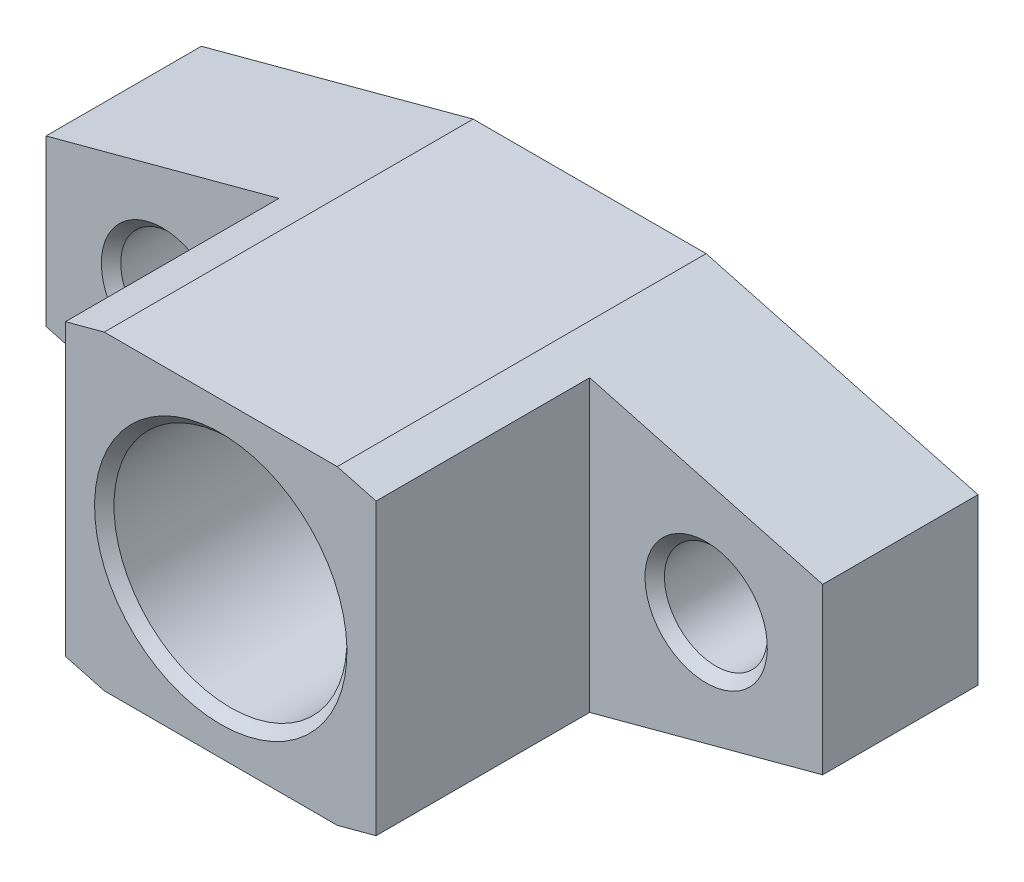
ISO-10303-21;
HEADER;
FILE_DESCRIPTION(('STEP AP214'),'2;1');
FILE_NAME('part.step','',(''),(''),'','','');
FILE_SCHEMA(('AUTOMOTIVE_DESIGN { 1 0 10303 214 1 1 1 1 }'));
ENDSEC;
DATA;
#1=APPLICATION_CONTEXT('core data for automotive mechanical design processes');
#2=APPLICATION_PROTOCOL_DEFINITION('international standard','automotive_design',2000,#1);
#3=PRODUCT_CONTEXT('',#1,'mechanical');
#4=PRODUCT('Part','Part','',(#3));
#5=PRODUCT_RELATED_PRODUCT_CATEGORY('part','',(#4));
#6=PRODUCT_DEFINITION_FORMATION('','',#4);
#7=PRODUCT_DEFINITION_CONTEXT('part definition',#1,'design');
#8=PRODUCT_DEFINITION('design','',#6,#7);
#9=PRODUCT_DEFINITION_SHAPE('','',#8);
#10=(LENGTH_UNIT() NAMED_UNIT(*) SI_UNIT(.MILLI.,.METRE.));
#11=(NAMED_UNIT(*) PLANE_ANGLE_UNIT() SI_UNIT($,.RADIAN.));
#12=(NAMED_UNIT(*) SI_UNIT($,.STERADIAN.) SOLID_ANGLE_UNIT());
#13=UNCERTAINTY_MEASURE_WITH_UNIT(LENGTH_MEASURE(1.E-05),#10,'distance_accuracy_value','');
#14=(GEOMETRIC_REPRESENTATION_CONTEXT(3) GLOBAL_UNCERTAINTY_ASSIGNED_CONTEXT((#13)) GLOBAL_UNIT_ASSIGNED_CONTEXT((#10,
#11,#12)) REPRESENTATION_CONTEXT('',''));
#15=CARTESIAN_POINT('',(0.,0.,0.));
#16=DIRECTION('',(0.,0.,1.));
#17=DIRECTION('',(1.,0.,0.));
#18=AXIS2_PLACEMENT_3D('',#15,#16,#17);
#19=CARTESIAN_POINT('',(34.,4.24871130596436,8.00000000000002));
#20=DIRECTION('',(0.,0.,-1.));
#21=DIRECTION('',(0.,1.,0.));
#22=AXIS2_PLACEMENT_3D('',#19,#20,#21);
#23=PLANE('',#22);
#24=CARTESIAN_POINT('',(28.,0.,8.));
#25=DIRECTION('',(0.,0.,-1.));
#26=DIRECTION('',(0.,1.,0.));
#27=AXIS2_PLACEMENT_3D('',#24,#25,#26);
#28=CIRCLE('',#27,3.15000000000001);
#29=CARTESIAN_POINT('',(28.,3.14999999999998,8.00000000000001));
#30=VERTEX_POINT('',#29);
#31=EDGE_CURVE('E229',#30,#30,#28,.T.);
#32=ORIENTED_EDGE('',*,*,#31,.T.);
#33=EDGE_LOOP('',(#32));
#34=FACE_BOUND('',#33,.T.);
#35=DIRECTION('',(0.,1.,0.));
#36=VECTOR('',#35,1.);
#37=CARTESIAN_POINT('',(22.,4.24871130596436,8.00000000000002));
#38=LINE('',#37,#36);
#39=CARTESIAN_POINT('',(22.,-7.46410161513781,7.99999999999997));
#40=VERTEX_POINT('',#39);
#41=CARTESIAN_POINT('',(22.,7.46410161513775,8.00000000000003));
#42=VERTEX_POINT('',#41);
#43=EDGE_CURVE('E151',#40,#42,#38,.T.);
#44=ORIENTED_EDGE('',*,*,#43,.F.);
#45=DIRECTION('',(0.96592582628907,0.258819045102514,0.));
#46=VECTOR('',#45,1.);
#47=CARTESIAN_POINT('',(34.,-4.24871130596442,7.99999999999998));
#48=LINE('',#47,#46);
#49=CARTESIAN_POINT('',(34.,-4.24871130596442,7.99999999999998));
#50=VERTEX_POINT('',#49);
#51=EDGE_CURVE('E150',#40,#50,#48,.T.);
#52=ORIENTED_EDGE('',*,*,#51,.T.);
#53=DIRECTION('',(0.,1.,0.));
#54=VECTOR('',#53,1.);
#55=CARTESIAN_POINT('',(34.,4.24871130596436,8.00000000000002));
#56=LINE('',#55,#54);
#57=CARTESIAN_POINT('',(34.,4.24871130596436,8.00000000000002));
#58=VERTEX_POINT('',#57);
#59=EDGE_CURVE('E169',#50,#58,#56,.T.);
#60=ORIENTED_EDGE('',*,*,#59,.T.);
#61=DIRECTION('',(-0.96592582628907,0.258819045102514,0.));
#62=VECTOR('',#61,1.);
#63=CARTESIAN_POINT('',(20.,7.99999999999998,8.00000000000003));
#64=LINE('',#63,#62);
#65=EDGE_CURVE('E51',#58,#42,#64,.T.);
#66=ORIENTED_EDGE('',*,*,#65,.T.);
#67=EDGE_LOOP('',(#44,#52,#60,#66));
#68=FACE_BOUND('',#67,.T.);
#69=ADVANCED_FACE('F36',(#34,#68),#23,.F.);
#70=CARTESIAN_POINT('',(0.,0.,8.));
#71=DIRECTION('',(0.,0.,-1.));
#72=DIRECTION('',(0.,1.,0.));
#73=AXIS2_PLACEMENT_3D('',#70,#71,#72);
#74=CIRCLE('',#73,3.15000000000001);
#75=CARTESIAN_POINT('',(0.,3.14999999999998,8.00000000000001));
#76=VERTEX_POINT('',#75);
#77=EDGE_CURVE('E220',#76,#76,#74,.T.);
#78=ORIENTED_EDGE('',*,*,#77,.T.);
#79=EDGE_LOOP('',(#78));
#80=FACE_BOUND('',#79,.T.);
#81=DIRECTION('',(0.,-1.,0.));
#82=VECTOR('',#81,1.);
#83=CARTESIAN_POINT('',(6.,4.24871130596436,8.00000000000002));
#84=LINE('',#83,#82);
#85=CARTESIAN_POINT('',(6.,7.46410161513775,8.00000000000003));
#86=VERTEX_POINT('',#85);
#87=CARTESIAN_POINT('',(6.00000000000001,-7.4641016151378,7.99999999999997));
#88=VERTEX_POINT('',#87);
#89=EDGE_CURVE('E59',#86,#88,#84,.T.);
#90=ORIENTED_EDGE('',*,*,#89,.F.);
#91=DIRECTION('',(-0.96592582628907,-0.258819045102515,0.));
#92=VECTOR('',#91,1.);
#93=CARTESIAN_POINT('',(8.00000000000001,7.99999999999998,8.00000000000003));
#94=LINE('',#93,#92);
#95=CARTESIAN_POINT('',(-5.99999999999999,4.24871130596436,8.00000000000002));
#96=VERTEX_POINT('',#95);
#97=EDGE_CURVE('E161',#86,#96,#94,.T.);
#98=ORIENTED_EDGE('',*,*,#97,.T.);
#99=DIRECTION('',(0.,-1.,0.));
#100=VECTOR('',#99,1.);
#101=CARTESIAN_POINT('',(-5.99999999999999,4.24871130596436,8.00000000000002));
#102=LINE('',#101,#100);
#103=CARTESIAN_POINT('',(-5.99999999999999,-4.24871130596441,7.99999999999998));
#104=VERTEX_POINT('',#103);
#105=EDGE_CURVE('E164',#96,#104,#102,.T.);
#106=ORIENTED_EDGE('',*,*,#105,.T.);
#107=DIRECTION('',(0.96592582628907,-0.258819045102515,0.));
#108=VECTOR('',#107,1.);
#109=CARTESIAN_POINT('',(-5.99999999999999,-4.24871130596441,7.99999999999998));
#110=LINE('',#109,#108);
#111=EDGE_CURVE('E166',#104,#88,#110,.T.);
#112=ORIENTED_EDGE('',*,*,#111,.T.);
#113=EDGE_LOOP('',(#90,#98,#106,#112));
#114=FACE_BOUND('',#113,.T.);
#115=ADVANCED_FACE('F259',(#80,#114),#23,.F.);
#116=CARTESIAN_POINT('',(34.,4.24871130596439,0.));
#117=DIRECTION('',(0.,0.,-1.));
#118=DIRECTION('',(0.,1.,0.));
#119=AXIS2_PLACEMENT_3D('',#116,#117,#118);
#120=PLANE('',#119);
#121=CARTESIAN_POINT('',(28.,0.,0.));
#122=DIRECTION('',(0.,0.,-1.));
#123=DIRECTION('',(0.,1.,0.));
#124=AXIS2_PLACEMENT_3D('',#121,#122,#123);
#125=CIRCLE('',#124,3.15000000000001);
#126=CARTESIAN_POINT('',(28.,3.15000000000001,0.));
#127=VERTEX_POINT('',#126);
#128=EDGE_CURVE('E44',#127,#127,#125,.F.);
#129=ORIENTED_EDGE('',*,*,#128,.T.);
#130=EDGE_LOOP('',(#129));
#131=FACE_BOUND('',#130,.T.);
#132=CARTESIAN_POINT('',(0.,0.,0.));
#133=DIRECTION('',(0.,0.,-1.));
#134=DIRECTION('',(0.,1.,0.));
#135=AXIS2_PLACEMENT_3D('',#132,#133,#134);
#136=CIRCLE('',#135,3.15);
#137=CARTESIAN_POINT('',(0.,3.14999999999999,0.));
#138=VERTEX_POINT('',#137);
#139=EDGE_CURVE('E235',#138,#138,#136,.F.);
#140=ORIENTED_EDGE('',*,*,#139,.T.);
#141=EDGE_LOOP('',(#140));
#142=FACE_BOUND('',#141,.T.);
#143=CARTESIAN_POINT('',(14.,0.,0.));
#144=DIRECTION('',(0.,0.,-1.));
#145=DIRECTION('',(0.,1.,0.));
#146=AXIS2_PLACEMENT_3D('',#143,#144,#145);
#147=CIRCLE('',#146,6.50000000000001);
#148=CARTESIAN_POINT('',(14.,6.50000000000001,0.));
#149=VERTEX_POINT('',#148);
#150=EDGE_CURVE('E232',#149,#149,#147,.F.);
#151=ORIENTED_EDGE('',*,*,#150,.T.);
#152=EDGE_LOOP('',(#151));
#153=FACE_BOUND('',#152,.T.);
#154=DIRECTION('',(-1.,0.,0.));
#155=VECTOR('',#154,1.);
#156=CARTESIAN_POINT('',(8.00000000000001,8.00000000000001,0.));
#157=LINE('',#156,#155);
#158=CARTESIAN_POINT('',(20.,8.00000000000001,0.));
#159=VERTEX_POINT('',#158);
#160=CARTESIAN_POINT('',(8.00000000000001,8.00000000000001,0.));
#161=VERTEX_POINT('',#160);
#162=EDGE_CURVE('E173',#159,#161,#157,.T.);
#163=ORIENTED_EDGE('',*,*,#162,.F.);
#164=DIRECTION('',(-0.96592582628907,0.258819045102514,0.));
#165=VECTOR('',#164,1.);
#166=CARTESIAN_POINT('',(20.,8.00000000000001,0.));
#167=LINE('',#166,#165);
#168=CARTESIAN_POINT('',(34.,4.24871130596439,0.));
#169=VERTEX_POINT('',#168);
#170=EDGE_CURVE('E159',#169,#159,#167,.T.);
#171=ORIENTED_EDGE('',*,*,#170,.F.);
#172=DIRECTION('',(0.,1.,0.));
#173=VECTOR('',#172,1.);
#174=CARTESIAN_POINT('',(34.,4.24871130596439,0.));
#175=LINE('',#174,#173);
#176=CARTESIAN_POINT('',(34.,-4.24871130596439,0.));
#177=VERTEX_POINT('',#176);
#178=EDGE_CURVE('E162',#177,#169,#175,.T.);
#179=ORIENTED_EDGE('',*,*,#178,.F.);
#180=DIRECTION('',(0.96592582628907,0.258819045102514,0.));
#181=VECTOR('',#180,1.);
#182=CARTESIAN_POINT('',(34.,-4.24871130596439,0.));
#183=LINE('',#182,#181);
#184=CARTESIAN_POINT('',(20.,-8.,0.));
#185=VERTEX_POINT('',#184);
#186=EDGE_CURVE('E183',#185,#177,#183,.T.);
#187=ORIENTED_EDGE('',*,*,#186,.F.);
#188=DIRECTION('',(1.,0.,0.));
#189=VECTOR('',#188,1.);
#190=CARTESIAN_POINT('',(7.99999999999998,-8.,0.));
#191=LINE('',#190,#189);
#192=CARTESIAN_POINT('',(7.99999999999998,-8.,0.));
#193=VERTEX_POINT('',#192);
#194=EDGE_CURVE('E181',#193,#185,#191,.T.);
#195=ORIENTED_EDGE('',*,*,#194,.F.);
#196=DIRECTION('',(0.96592582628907,-0.258819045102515,0.));
#197=VECTOR('',#196,1.);
#198=CARTESIAN_POINT('',(-5.99999999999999,-4.24871130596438,0.));
#199=LINE('',#198,#197);
#200=CARTESIAN_POINT('',(-5.99999999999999,-4.24871130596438,0.));
#201=VERTEX_POINT('',#200);
#202=EDGE_CURVE('E179',#201,#193,#199,.T.);
#203=ORIENTED_EDGE('',*,*,#202,.F.);
#204=DIRECTION('',(0.,-1.,0.));
#205=VECTOR('',#204,1.);
#206=CARTESIAN_POINT('',(-5.99999999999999,4.24871130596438,0.));
#207=LINE('',#206,#205);
#208=CARTESIAN_POINT('',(-5.99999999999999,4.24871130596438,0.));
#209=VERTEX_POINT('',#208);
#210=EDGE_CURVE('E177',#209,#201,#207,.T.);
#211=ORIENTED_EDGE('',*,*,#210,.F.);
#212=DIRECTION('',(-0.96592582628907,-0.258819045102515,0.));
#213=VECTOR('',#212,1.);
#214=CARTESIAN_POINT('',(8.00000000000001,8.00000000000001,0.));
#215=LINE('',#214,#213);
#216=EDGE_CURVE('E175',#161,#209,#215,.T.);
#217=ORIENTED_EDGE('',*,*,#216,.F.);
#218=EDGE_LOOP('',(#163,#171,#179,#187,#195,#203,#211,#217));
#219=FACE_BOUND('',#218,.T.);
#220=ADVANCED_FACE('F240',(#131,#142,#153,#219),#120,.T.);
#221=CARTESIAN_POINT('',(20.,7.99999999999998,8.00000000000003));
#222=DIRECTION('',(-0.258819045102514,-0.96592582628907,0.));
#223=DIRECTION('',(0.96592582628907,-0.258819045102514,0.));
#224=AXIS2_PLACEMENT_3D('',#221,#222,#223);
#225=PLANE('',#224);
#226=DIRECTION('',(0.,0.,-1.));
#227=VECTOR('',#226,1.);
#228=CARTESIAN_POINT('',(20.,7.99999999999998,8.00000000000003));
#229=LINE('',#228,#227);
#230=CARTESIAN_POINT('',(20.,7.99999999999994,19.));
#231=VERTEX_POINT('',#230);
#232=EDGE_CURVE('E205',#231,#159,#229,.T.);
#233=ORIENTED_EDGE('',*,*,#232,.F.);
#234=DIRECTION('',(-0.96592582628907,0.258819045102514,0.));
#235=VECTOR('',#234,1.);
#236=CARTESIAN_POINT('',(22.,7.46410161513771,19.));
#237=LINE('',#236,#235);
#238=CARTESIAN_POINT('',(22.,7.46410161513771,19.));
#239=VERTEX_POINT('',#238);
#240=EDGE_CURVE('E135',#239,#231,#237,.T.);
#241=ORIENTED_EDGE('',*,*,#240,.F.);
#242=DIRECTION('',(0.,0.,-1.));
#243=VECTOR('',#242,1.);
#244=CARTESIAN_POINT('',(22.,7.46410161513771,19.));
#245=LINE('',#244,#243);
#246=EDGE_CURVE('E131',#239,#42,#245,.T.);
#247=ORIENTED_EDGE('',*,*,#246,.T.);
#248=ORIENTED_EDGE('',*,*,#65,.F.);
#249=DIRECTION('',(0.,0.,-1.));
#250=VECTOR('',#249,1.);
#251=CARTESIAN_POINT('',(34.,4.24871130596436,8.00000000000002));
#252=LINE('',#251,#250);
#253=EDGE_CURVE('E171',#58,#169,#252,.T.);
#254=ORIENTED_EDGE('',*,*,#253,.T.);
#255=ORIENTED_EDGE('',*,*,#170,.T.);
#256=EDGE_LOOP('',(#233,#241,#247,#248,#254,#255));
#257=FACE_BOUND('',#256,.T.);
#258=ADVANCED_FACE('F272',(#257),#225,.F.);
#259=CARTESIAN_POINT('',(8.00000000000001,7.99999999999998,8.00000000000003));
#260=DIRECTION('',(0.,-1.,0.));
#261=DIRECTION('',(1.,0.,0.));
#262=AXIS2_PLACEMENT_3D('',#259,#260,#261);
#263=PLANE('',#262);
#264=ORIENTED_EDGE('',*,*,#162,.T.);
#265=DIRECTION('',(0.,0.,-1.));
#266=VECTOR('',#265,1.);
#267=CARTESIAN_POINT('',(8.00000000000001,7.99999999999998,8.00000000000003));
#268=LINE('',#267,#266);
#269=CARTESIAN_POINT('',(8.00000000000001,7.99999999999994,19.));
#270=VERTEX_POINT('',#269);
#271=EDGE_CURVE('E202',#270,#161,#268,.T.);
#272=ORIENTED_EDGE('',*,*,#271,.F.);
#273=DIRECTION('',(-1.,0.,0.));
#274=VECTOR('',#273,1.);
#275=CARTESIAN_POINT('',(20.,7.99999999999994,19.));
#276=LINE('',#275,#274);
#277=EDGE_CURVE('E332',#231,#270,#276,.T.);
#278=ORIENTED_EDGE('',*,*,#277,.F.);
#279=ORIENTED_EDGE('',*,*,#232,.T.);
#280=EDGE_LOOP('',(#264,#272,#278,#279));
#281=FACE_BOUND('',#280,.T.);
#282=ADVANCED_FACE('F294',(#281),#263,.F.);
#283=CARTESIAN_POINT('',(8.00000000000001,7.99999999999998,8.00000000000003));
#284=DIRECTION('',(0.258819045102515,-0.96592582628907,0.));
#285=DIRECTION('',(0.96592582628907,0.258819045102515,0.));
#286=AXIS2_PLACEMENT_3D('',#283,#284,#285);
#287=PLANE('',#286);
#288=ORIENTED_EDGE('',*,*,#216,.T.);
#289=DIRECTION('',(0.,0.,-1.));
#290=VECTOR('',#289,1.);
#291=CARTESIAN_POINT('',(-5.99999999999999,4.24871130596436,8.00000000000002));
#292=LINE('',#291,#290);
#293=EDGE_CURVE('E199',#96,#209,#292,.T.);
#294=ORIENTED_EDGE('',*,*,#293,.F.);
#295=ORIENTED_EDGE('',*,*,#97,.F.);
#296=DIRECTION('',(0.,0.,-1.));
#297=VECTOR('',#296,1.);
#298=CARTESIAN_POINT('',(6.,7.46410161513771,19.));
#299=LINE('',#298,#297);
#300=CARTESIAN_POINT('',(6.,7.46410161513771,19.));
#301=VERTEX_POINT('',#300);
#302=EDGE_CURVE('E154',#301,#86,#299,.T.);
#303=ORIENTED_EDGE('',*,*,#302,.F.);
#304=DIRECTION('',(-0.96592582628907,-0.258819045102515,0.));
#305=VECTOR('',#304,1.);
#306=CARTESIAN_POINT('',(8.00000000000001,7.99999999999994,19.));
#307=LINE('',#306,#305);
#308=EDGE_CURVE('E335',#270,#301,#307,.T.);
#309=ORIENTED_EDGE('',*,*,#308,.F.);
#310=ORIENTED_EDGE('',*,*,#271,.T.);
#311=EDGE_LOOP('',(#288,#294,#295,#303,#309,#310));
#312=FACE_BOUND('',#311,.T.);
#313=ADVANCED_FACE('F290',(#312),#287,.F.);
#314=CARTESIAN_POINT('',(-5.99999999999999,4.24871130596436,8.00000000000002));
#315=DIRECTION('',(1.,0.,0.));
#316=DIRECTION('',(0.,1.,0.));
#317=AXIS2_PLACEMENT_3D('',#314,#315,#316);
#318=PLANE('',#317);
#319=ORIENTED_EDGE('',*,*,#210,.T.);
#320=DIRECTION('',(0.,0.,-1.));
#321=VECTOR('',#320,1.);
#322=CARTESIAN_POINT('',(-5.99999999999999,-4.24871130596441,7.99999999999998));
#323=LINE('',#322,#321);
#324=EDGE_CURVE('E196',#104,#201,#323,.T.);
#325=ORIENTED_EDGE('',*,*,#324,.F.);
#326=ORIENTED_EDGE('',*,*,#105,.F.);
#327=ORIENTED_EDGE('',*,*,#293,.T.);
#328=EDGE_LOOP('',(#319,#325,#326,#327));
#329=FACE_BOUND('',#328,.T.);
#330=ADVANCED_FACE('F286',(#329),#318,.F.);
#331=CARTESIAN_POINT('',(-5.99999999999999,-4.24871130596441,7.99999999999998));
#332=DIRECTION('',(0.258819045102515,0.96592582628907,0.));
#333=DIRECTION('',(-0.96592582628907,0.258819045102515,0.));
#334=AXIS2_PLACEMENT_3D('',#331,#332,#333);
#335=PLANE('',#334);
#336=DIRECTION('',(0.,0.,-1.));
#337=VECTOR('',#336,1.);
#338=CARTESIAN_POINT('',(7.99999999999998,-8.00000000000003,7.99999999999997));
#339=LINE('',#338,#337);
#340=CARTESIAN_POINT('',(7.99999999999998,-8.00000000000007,19.));
#341=VERTEX_POINT('',#340);
#342=EDGE_CURVE('E193',#341,#193,#339,.T.);
#343=ORIENTED_EDGE('',*,*,#342,.F.);
#344=DIRECTION('',(0.96592582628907,-0.258819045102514,0.));
#345=VECTOR('',#344,1.);
#346=CARTESIAN_POINT('',(6.00000000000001,-7.46410161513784,19.));
#347=LINE('',#346,#345);
#348=CARTESIAN_POINT('',(6.00000000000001,-7.46410161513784,19.));
#349=VERTEX_POINT('',#348);
#350=EDGE_CURVE('E341',#349,#341,#347,.T.);
#351=ORIENTED_EDGE('',*,*,#350,.F.);
#352=DIRECTION('',(0.,0.,-1.));
#353=VECTOR('',#352,1.);
#354=CARTESIAN_POINT('',(6.00000000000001,-7.46410161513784,19.));
#355=LINE('',#354,#353);
#356=EDGE_CURVE('E344',#349,#88,#355,.T.);
#357=ORIENTED_EDGE('',*,*,#356,.T.);
#358=ORIENTED_EDGE('',*,*,#111,.F.);
#359=ORIENTED_EDGE('',*,*,#324,.T.);
#360=ORIENTED_EDGE('',*,*,#202,.T.);
#361=EDGE_LOOP('',(#343,#351,#357,#358,#359,#360));
#362=FACE_BOUND('',#361,.T.);
#363=ADVANCED_FACE('F282',(#362),#335,.F.);
#364=CARTESIAN_POINT('',(7.99999999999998,-8.00000000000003,7.99999999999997));
#365=DIRECTION('',(0.,1.,0.));
#366=DIRECTION('',(-1.,0.,0.));
#367=AXIS2_PLACEMENT_3D('',#364,#365,#366);
#368=PLANE('',#367);
#369=ORIENTED_EDGE('',*,*,#194,.T.);
#370=DIRECTION('',(0.,0.,-1.));
#371=VECTOR('',#370,1.);
#372=CARTESIAN_POINT('',(20.,-8.00000000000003,7.99999999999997));
#373=LINE('',#372,#371);
#374=CARTESIAN_POINT('',(20.,-8.00000000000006,19.));
#375=VERTEX_POINT('',#374);
#376=EDGE_CURVE('E191',#375,#185,#373,.T.);
#377=ORIENTED_EDGE('',*,*,#376,.F.);
#378=DIRECTION('',(1.,0.,0.));
#379=VECTOR('',#378,1.);
#380=CARTESIAN_POINT('',(20.,-8.00000000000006,19.));
#381=LINE('',#380,#379);
#382=EDGE_CURVE('E143',#341,#375,#381,.T.);
#383=ORIENTED_EDGE('',*,*,#382,.F.);
#384=ORIENTED_EDGE('',*,*,#342,.T.);
#385=EDGE_LOOP('',(#369,#377,#383,#384));
#386=FACE_BOUND('',#385,.T.);
#387=ADVANCED_FACE('F279',(#386),#368,.F.);
#388=CARTESIAN_POINT('',(34.,-4.24871130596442,7.99999999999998));
#389=DIRECTION('',(-0.258819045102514,0.96592582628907,0.));
#390=DIRECTION('',(-0.96592582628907,-0.258819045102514,0.));
#391=AXIS2_PLACEMENT_3D('',#388,#389,#390);
#392=PLANE('',#391);
#393=ORIENTED_EDGE('',*,*,#186,.T.);
#394=DIRECTION('',(0.,0.,-1.));
#395=VECTOR('',#394,1.);
#396=CARTESIAN_POINT('',(34.,-4.24871130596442,7.99999999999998));
#397=LINE('',#396,#395);
#398=EDGE_CURVE('E188',#50,#177,#397,.T.);
#399=ORIENTED_EDGE('',*,*,#398,.F.);
#400=ORIENTED_EDGE('',*,*,#51,.F.);
#401=DIRECTION('',(0.,0.,-1.));
#402=VECTOR('',#401,1.);
#403=CARTESIAN_POINT('',(22.,-7.46410161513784,19.));
#404=LINE('',#403,#402);
#405=CARTESIAN_POINT('',(22.,-7.46410161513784,19.));
#406=VERTEX_POINT('',#405);
#407=EDGE_CURVE('E129',#406,#40,#404,.T.);
#408=ORIENTED_EDGE('',*,*,#407,.F.);
#409=DIRECTION('',(0.96592582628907,0.258819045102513,0.));
#410=VECTOR('',#409,1.);
#411=CARTESIAN_POINT('',(20.,-8.00000000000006,19.));
#412=LINE('',#411,#410);
#413=EDGE_CURVE('E136',#375,#406,#412,.T.);
#414=ORIENTED_EDGE('',*,*,#413,.F.);
#415=ORIENTED_EDGE('',*,*,#376,.T.);
#416=EDGE_LOOP('',(#393,#399,#400,#408,#414,#415));
#417=FACE_BOUND('',#416,.T.);
#418=ADVANCED_FACE('F148',(#417),#392,.F.);
#419=CARTESIAN_POINT('',(34.,4.24871130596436,8.00000000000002));
#420=DIRECTION('',(-1.,0.,0.));
#421=DIRECTION('',(0.,-1.,0.));
#422=AXIS2_PLACEMENT_3D('',#419,#420,#421);
#423=PLANE('',#422);
#424=ORIENTED_EDGE('',*,*,#178,.T.);
#425=ORIENTED_EDGE('',*,*,#253,.F.);
#426=ORIENTED_EDGE('',*,*,#59,.F.);
#427=ORIENTED_EDGE('',*,*,#398,.T.);
#428=EDGE_LOOP('',(#424,#425,#426,#427));
#429=FACE_BOUND('',#428,.T.);
#430=ADVANCED_FACE('F273',(#429),#423,.F.);
#431=CARTESIAN_POINT('',(28.,0.,8.));
#432=DIRECTION('',(0.,0.,-1.));
#433=DIRECTION('',(0.,1.,0.));
#434=AXIS2_PLACEMENT_3D('',#431,#432,#433);
#435=CYLINDRICAL_SURFACE('',#434,2.65);
#436=CARTESIAN_POINT('',(28.,0.,7.5));
#437=DIRECTION('',(0.,0.,-1.));
#438=DIRECTION('',(0.,1.,0.));
#439=AXIS2_PLACEMENT_3D('',#436,#437,#438);
#440=CIRCLE('',#439,2.65);
#441=CARTESIAN_POINT('',(28.,2.64999999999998,7.50000000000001));
#442=VERTEX_POINT('',#441);
#443=EDGE_CURVE('E226',#442,#442,#440,.F.);
#444=ORIENTED_EDGE('',*,*,#443,.T.);
#445=EDGE_LOOP('',(#444));
#446=FACE_BOUND('',#445,.T.);
#447=CARTESIAN_POINT('',(28.,0.,0.500000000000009));
#448=DIRECTION('',(0.,0.,-1.));
#449=DIRECTION('',(0.,1.,0.));
#450=AXIS2_PLACEMENT_3D('',#447,#448,#449);
#451=CIRCLE('',#450,2.65);
#452=CARTESIAN_POINT('',(28.,2.65,0.500000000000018));
#453=VERTEX_POINT('',#452);
#454=EDGE_CURVE('E223',#453,#453,#451,.T.);
#455=ORIENTED_EDGE('',*,*,#454,.T.);
#456=EDGE_LOOP('',(#455));
#457=FACE_BOUND('',#456,.T.);
#458=ADVANCED_FACE('F268',(#446,#457),#435,.F.);
#459=CARTESIAN_POINT('',(0.,0.,8.));
#460=DIRECTION('',(0.,0.,-1.));
#461=DIRECTION('',(0.,1.,0.));
#462=AXIS2_PLACEMENT_3D('',#459,#460,#461);
#463=CYLINDRICAL_SURFACE('',#462,2.65);
#464=CARTESIAN_POINT('',(0.,0.,7.49999999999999));
#465=DIRECTION('',(0.,0.,-1.));
#466=DIRECTION('',(0.,1.,0.));
#467=AXIS2_PLACEMENT_3D('',#464,#465,#466);
#468=CIRCLE('',#467,2.65);
#469=CARTESIAN_POINT('',(0.,2.64999999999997,7.5));
#470=VERTEX_POINT('',#469);
#471=EDGE_CURVE('E217',#470,#470,#468,.F.);
#472=ORIENTED_EDGE('',*,*,#471,.T.);
#473=EDGE_LOOP('',(#472));
#474=FACE_BOUND('',#473,.T.);
#475=CARTESIAN_POINT('',(0.,0.,0.500000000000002));
#476=DIRECTION('',(0.,0.,-1.));
#477=DIRECTION('',(0.,1.,0.));
#478=AXIS2_PLACEMENT_3D('',#475,#476,#477);
#479=CIRCLE('',#478,2.65);
#480=CARTESIAN_POINT('',(0.,2.64999999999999,0.500000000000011));
#481=VERTEX_POINT('',#480);
#482=EDGE_CURVE('E214',#481,#481,#479,.T.);
#483=ORIENTED_EDGE('',*,*,#482,.T.);
#484=EDGE_LOOP('',(#483));
#485=FACE_BOUND('',#484,.T.);
#486=ADVANCED_FACE('F315',(#474,#485),#463,.F.);
#487=CARTESIAN_POINT('',(6.00000000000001,-7.46410161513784,19.));
#488=DIRECTION('',(1.,0.,0.));
#489=DIRECTION('',(0.,1.,0.));
#490=AXIS2_PLACEMENT_3D('',#487,#488,#489);
#491=PLANE('',#490);
#492=ORIENTED_EDGE('',*,*,#302,.T.);
#493=ORIENTED_EDGE('',*,*,#89,.T.);
#494=ORIENTED_EDGE('',*,*,#356,.F.);
#495=DIRECTION('',(0.,-1.,0.));
#496=VECTOR('',#495,1.);
#497=CARTESIAN_POINT('',(6.00000000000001,-7.46410161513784,19.));
#498=LINE('',#497,#496);
#499=EDGE_CURVE('E339',#301,#349,#498,.T.);
#500=ORIENTED_EDGE('',*,*,#499,.F.);
#501=EDGE_LOOP('',(#492,#493,#494,#500));
#502=FACE_BOUND('',#501,.T.);
#503=ADVANCED_FACE('F318',(#502),#491,.F.);
#504=CARTESIAN_POINT('',(22.,-7.46410161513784,19.));
#505=DIRECTION('',(-1.,0.,0.));
#506=DIRECTION('',(0.,-1.,0.));
#507=AXIS2_PLACEMENT_3D('',#504,#505,#506);
#508=PLANE('',#507);
#509=ORIENTED_EDGE('',*,*,#407,.T.);
#510=ORIENTED_EDGE('',*,*,#43,.T.);
#511=ORIENTED_EDGE('',*,*,#246,.F.);
#512=DIRECTION('',(0.,1.,0.));
#513=VECTOR('',#512,1.);
#514=CARTESIAN_POINT('',(22.,-7.46410161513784,19.));
#515=LINE('',#514,#513);
#516=EDGE_CURVE('E125',#406,#239,#515,.T.);
#517=ORIENTED_EDGE('',*,*,#516,.F.);
#518=EDGE_LOOP('',(#509,#510,#511,#517));
#519=FACE_BOUND('',#518,.T.);
#520=ADVANCED_FACE('F127',(#519),#508,.F.);
#521=CARTESIAN_POINT('',(6.00000000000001,-11.7512886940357,19.));
#522=DIRECTION('',(0.,0.,1.));
#523=DIRECTION('',(0.,-1.,0.));
#524=AXIS2_PLACEMENT_3D('',#521,#522,#523);
#525=PLANE('',#524);
#526=CARTESIAN_POINT('',(14.,0.,19.));
#527=DIRECTION('',(0.,0.,1.));
#528=DIRECTION('',(0.,-1.,0.));
#529=AXIS2_PLACEMENT_3D('',#526,#527,#528);
#530=CIRCLE('',#529,6.5);
#531=CARTESIAN_POINT('',(14.,-6.50000000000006,19.));
#532=VERTEX_POINT('',#531);
#533=EDGE_CURVE('E208',#532,#532,#530,.F.);
#534=ORIENTED_EDGE('',*,*,#533,.T.);
#535=EDGE_LOOP('',(#534));
#536=FACE_BOUND('',#535,.T.);
#537=ORIENTED_EDGE('',*,*,#413,.T.);
#538=ORIENTED_EDGE('',*,*,#516,.T.);
#539=ORIENTED_EDGE('',*,*,#240,.T.);
#540=ORIENTED_EDGE('',*,*,#277,.T.);
#541=ORIENTED_EDGE('',*,*,#308,.T.);
#542=ORIENTED_EDGE('',*,*,#499,.T.);
#543=ORIENTED_EDGE('',*,*,#350,.T.);
#544=ORIENTED_EDGE('',*,*,#382,.T.);
#545=EDGE_LOOP('',(#537,#538,#539,#540,#541,#542,#543,#544));
#546=FACE_BOUND('',#545,.T.);
#547=ADVANCED_FACE('F140',(#536,#546),#525,.T.);
#548=CARTESIAN_POINT('',(14.,0.,19.));
#549=DIRECTION('',(0.,0.,-1.));
#550=DIRECTION('',(0.,1.,0.));
#551=AXIS2_PLACEMENT_3D('',#548,#549,#550);
#552=CYLINDRICAL_SURFACE('',#551,6.);
#553=CARTESIAN_POINT('',(14.,0.,0.500000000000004));
#554=DIRECTION('',(0.,0.,-1.));
#555=DIRECTION('',(0.,1.,0.));
#556=AXIS2_PLACEMENT_3D('',#553,#554,#555);
#557=CIRCLE('',#556,6.);
#558=CARTESIAN_POINT('',(14.,6.,0.500000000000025));
#559=VERTEX_POINT('',#558);
#560=EDGE_CURVE('E11',#559,#559,#557,.T.);
#561=ORIENTED_EDGE('',*,*,#560,.T.);
#562=EDGE_LOOP('',(#561));
#563=FACE_BOUND('',#562,.T.);
#564=CARTESIAN_POINT('',(14.,0.,18.5));
#565=DIRECTION('',(0.,0.,1.));
#566=DIRECTION('',(0.,-1.,0.));
#567=AXIS2_PLACEMENT_3D('',#564,#565,#566);
#568=CIRCLE('',#567,6.);
#569=CARTESIAN_POINT('',(14.,-6.00000000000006,18.5));
#570=VERTEX_POINT('',#569);
#571=EDGE_CURVE('E211',#570,#570,#568,.T.);
#572=ORIENTED_EDGE('',*,*,#571,.T.);
#573=EDGE_LOOP('',(#572));
#574=FACE_BOUND('',#573,.T.);
#575=ADVANCED_FACE('F305',(#563,#574),#552,.F.);
#576=CARTESIAN_POINT('',(14.,0.,19.));
#577=DIRECTION('',(0.,0.,1.));
#578=DIRECTION('',(0.,-1.,0.));
#579=AXIS2_PLACEMENT_3D('',#576,#577,#578);
#580=CONICAL_SURFACE('',#579,6.5,0.785398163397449);
#581=ORIENTED_EDGE('',*,*,#571,.F.);
#582=EDGE_LOOP('',(#581));
#583=FACE_BOUND('',#582,.T.);
#584=ORIENTED_EDGE('',*,*,#533,.F.);
#585=EDGE_LOOP('',(#584));
#586=FACE_BOUND('',#585,.T.);
#587=ADVANCED_FACE('F302',(#583,#586),#580,.F.);
#588=CARTESIAN_POINT('',(0.,0.,7.49999999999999));
#589=DIRECTION('',(0.,0.,1.));
#590=DIRECTION('',(0.,-1.,0.));
#591=AXIS2_PLACEMENT_3D('',#588,#589,#590);
#592=CONICAL_SURFACE('',#591,2.65,0.785398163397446);
#593=ORIENTED_EDGE('',*,*,#77,.F.);
#594=EDGE_LOOP('',(#593));
#595=FACE_BOUND('',#594,.T.);
#596=ORIENTED_EDGE('',*,*,#471,.F.);
#597=EDGE_LOOP('',(#596));
#598=FACE_BOUND('',#597,.T.);
#599=ADVANCED_FACE('F254',(#595,#598),#592,.F.);
#600=CARTESIAN_POINT('',(28.,0.,7.5));
#601=DIRECTION('',(0.,0.,1.));
#602=DIRECTION('',(0.,-1.,0.));
#603=AXIS2_PLACEMENT_3D('',#600,#601,#602);
#604=CONICAL_SURFACE('',#603,2.65,0.785398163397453);
#605=ORIENTED_EDGE('',*,*,#31,.F.);
#606=EDGE_LOOP('',(#605));
#607=FACE_BOUND('',#606,.T.);
#608=ORIENTED_EDGE('',*,*,#443,.F.);
#609=EDGE_LOOP('',(#608));
#610=FACE_BOUND('',#609,.T.);
#611=ADVANCED_FACE('F246',(#607,#610),#604,.F.);
#612=CARTESIAN_POINT('',(28.,0.,0.));
#613=DIRECTION('',(0.,0.,-1.));
#614=DIRECTION('',(0.,1.,0.));
#615=AXIS2_PLACEMENT_3D('',#612,#613,#614);
#616=CONICAL_SURFACE('',#615,3.15000000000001,0.785398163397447);
#617=ORIENTED_EDGE('',*,*,#454,.F.);
#618=EDGE_LOOP('',(#617));
#619=FACE_BOUND('',#618,.T.);
#620=ORIENTED_EDGE('',*,*,#128,.F.);
#621=EDGE_LOOP('',(#620));
#622=FACE_BOUND('',#621,.T.);
#623=ADVANCED_FACE('F243',(#619,#622),#616,.F.);
#624=CARTESIAN_POINT('',(0.,0.,0.));
#625=DIRECTION('',(0.,0.,-1.));
#626=DIRECTION('',(0.,1.,0.));
#627=AXIS2_PLACEMENT_3D('',#624,#625,#626);
#628=CONICAL_SURFACE('',#627,3.15,0.785398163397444);
#629=ORIENTED_EDGE('',*,*,#482,.F.);
#630=EDGE_LOOP('',(#629));
#631=FACE_BOUND('',#630,.T.);
#632=ORIENTED_EDGE('',*,*,#139,.F.);
#633=EDGE_LOOP('',(#632));
#634=FACE_BOUND('',#633,.T.);
#635=ADVANCED_FACE('F245',(#631,#634),#628,.F.);
#636=CARTESIAN_POINT('',(14.,0.,0.500000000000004));
#637=DIRECTION('',(0.,0.,-1.));
#638=DIRECTION('',(0.,1.,0.));
#639=AXIS2_PLACEMENT_3D('',#636,#637,#638);
#640=CONICAL_SURFACE('',#639,6.,0.785398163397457);
#641=ORIENTED_EDGE('',*,*,#150,.F.);
#642=EDGE_LOOP('',(#641));
#643=FACE_BOUND('',#642,.T.);
#644=ORIENTED_EDGE('',*,*,#560,.F.);
#645=EDGE_LOOP('',(#644));
#646=FACE_BOUND('',#645,.T.);
#647=ADVANCED_FACE('F38',(#643,#646),#640,.F.);
#648=CLOSED_SHELL('',(#69,#115,#220,#258,#282,#313,#330,#363,#387,#418,#430,#458,#486,#503,#520,
#547,#575,#587,#599,#611,#623,#635,#647));
#649=MANIFOLD_SOLID_BREP('B2',#648);
#650=ADVANCED_BREP_SHAPE_REPRESENTATION('',(#18,#649),#14);
#651=SHAPE_DEFINITION_REPRESENTATION(#9,#650);
ENDSEC;
END-ISO-10303-21;
